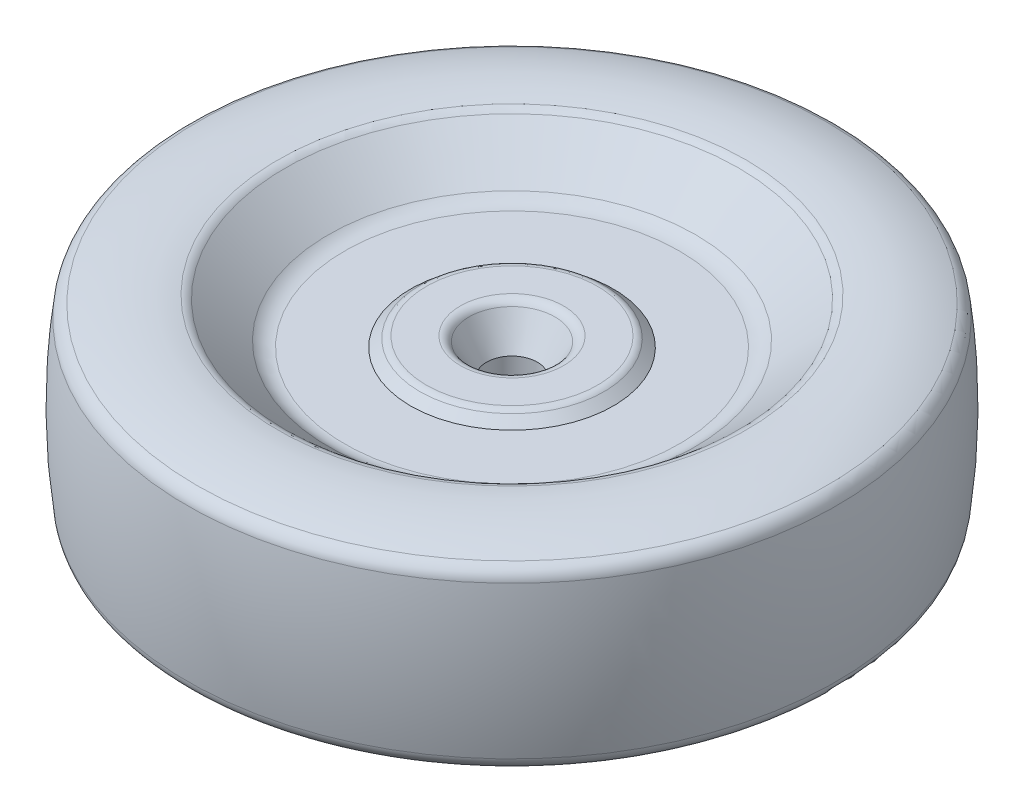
ISO-10303-21;
HEADER;
FILE_DESCRIPTION(('STEP AP214'),'2;1');
FILE_NAME('part.step','',(''),(''),'','','');
FILE_SCHEMA(('AUTOMOTIVE_DESIGN { 1 0 10303 214 1 1 1 1 }'));
ENDSEC;
DATA;
#1=APPLICATION_CONTEXT('core data for automotive mechanical design processes');
#2=APPLICATION_PROTOCOL_DEFINITION('international standard','automotive_design',2000,#1);
#3=PRODUCT_CONTEXT('',#1,'mechanical');
#4=PRODUCT('Part','Part','',(#3));
#5=PRODUCT_RELATED_PRODUCT_CATEGORY('part','',(#4));
#6=PRODUCT_DEFINITION_FORMATION('','',#4);
#7=PRODUCT_DEFINITION_CONTEXT('part definition',#1,'design');
#8=PRODUCT_DEFINITION('design','',#6,#7);
#9=PRODUCT_DEFINITION_SHAPE('','',#8);
#10=(LENGTH_UNIT() NAMED_UNIT(*) SI_UNIT(.MILLI.,.METRE.));
#11=(NAMED_UNIT(*) PLANE_ANGLE_UNIT() SI_UNIT($,.RADIAN.));
#12=(NAMED_UNIT(*) SI_UNIT($,.STERADIAN.) SOLID_ANGLE_UNIT());
#13=UNCERTAINTY_MEASURE_WITH_UNIT(LENGTH_MEASURE(1.E-05),#10,'distance_accuracy_value','');
#14=(GEOMETRIC_REPRESENTATION_CONTEXT(3) GLOBAL_UNCERTAINTY_ASSIGNED_CONTEXT((#13)) GLOBAL_UNIT_ASSIGNED_CONTEXT((#10,
#11,#12)) REPRESENTATION_CONTEXT('',''));
#15=CARTESIAN_POINT('',(0.,0.,0.));
#16=DIRECTION('',(0.,0.,1.));
#17=DIRECTION('',(1.,0.,0.));
#18=AXIS2_PLACEMENT_3D('',#15,#16,#17);
#19=CARTESIAN_POINT('',(0.,0.,0.));
#20=DIRECTION('',(0.,-1.,0.));
#21=DIRECTION('',(0.,0.,-1.));
#22=AXIS2_PLACEMENT_3D('',#19,#20,#21);
#23=DEGENERATE_TOROIDAL_SURFACE('',#22,55.,120.,.F.);
#24=CARTESIAN_POINT('',(0.,15.,0.));
#25=DIRECTION('',(0.,-1.,0.));
#26=DIRECTION('',(0.,0.,-1.));
#27=AXIS2_PLACEMENT_3D('',#24,#25,#26);
#28=CIRCLE('',#27,64.0588089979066);
#29=CARTESIAN_POINT('',(0.,15.,-64.0588089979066));
#30=VERTEX_POINT('',#29);
#31=EDGE_CURVE('E80',#30,#30,#28,.T.);
#32=ORIENTED_EDGE('',*,*,#31,.T.);
#33=EDGE_LOOP('',(#32));
#34=FACE_BOUND('',#33,.T.);
#35=CARTESIAN_POINT('',(0.,-15.,0.));
#36=DIRECTION('',(0.,-1.,0.));
#37=DIRECTION('',(0.,0.,-1.));
#38=AXIS2_PLACEMENT_3D('',#35,#36,#37);
#39=CIRCLE('',#38,64.0588089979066);
#40=CARTESIAN_POINT('',(0.,-15.,-64.0588089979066));
#41=VERTEX_POINT('',#40);
#42=EDGE_CURVE('E44',#41,#41,#39,.T.);
#43=ORIENTED_EDGE('',*,*,#42,.F.);
#44=EDGE_LOOP('',(#43));
#45=FACE_BOUND('',#44,.T.);
#46=ADVANCED_FACE('F34',(#34,#45),#23,.F.);
#47=CARTESIAN_POINT('',(0.,-14.625,0.));
#48=DIRECTION('',(0.,-1.,0.));
#49=DIRECTION('',(0.,0.,-1.));
#50=AXIS2_PLACEMENT_3D('',#47,#48,#49);
#51=TOROIDAL_SURFACE('',#50,61.0823387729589,3.00000000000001);
#52=ORIENTED_EDGE('',*,*,#42,.T.);
#53=EDGE_LOOP('',(#52));
#54=FACE_BOUND('',#53,.T.);
#55=CARTESIAN_POINT('',(0.,-17.4455272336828,0.));
#56=DIRECTION('',(0.,-1.,0.));
#57=DIRECTION('',(0.,0.,-1.));
#58=AXIS2_PLACEMENT_3D('',#55,#56,#57);
#59=CIRCLE('',#58,62.1044083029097);
#60=CARTESIAN_POINT('',(0.,-17.4455272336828,-62.1044083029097));
#61=VERTEX_POINT('',#60);
#62=EDGE_CURVE('E48',#61,#61,#59,.T.);
#63=ORIENTED_EDGE('',*,*,#62,.F.);
#64=EDGE_LOOP('',(#63));
#65=FACE_BOUND('',#64,.T.);
#66=ADVANCED_FACE('F126',(#54,#65),#51,.T.);
#67=CARTESIAN_POINT('',(0.,12.6400965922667,0.));
#68=DIRECTION('',(0.,-1.,0.));
#69=DIRECTION('',(0.,0.,-1.));
#70=AXIS2_PLACEMENT_3D('',#67,#68,#69);
#71=TOROIDAL_SURFACE('',#70,51.2023333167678,32.);
#72=ORIENTED_EDGE('',*,*,#62,.T.);
#73=EDGE_LOOP('',(#72));
#74=FACE_BOUND('',#73,.T.);
#75=CARTESIAN_POINT('',(0.,-18.9627686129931,0.));
#76=DIRECTION('',(0.,-1.,0.));
#77=DIRECTION('',(0.,0.,-1.));
#78=AXIS2_PLACEMENT_3D('',#75,#76,#77);
#79=CIRCLE('',#78,46.1765089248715);
#80=CARTESIAN_POINT('',(0.,-18.9627686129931,-46.1765089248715));
#81=VERTEX_POINT('',#80);
#82=EDGE_CURVE('E53',#81,#81,#79,.T.);
#83=ORIENTED_EDGE('',*,*,#82,.F.);
#84=EDGE_LOOP('',(#83));
#85=FACE_BOUND('',#84,.T.);
#86=ADVANCED_FACE('F131',(#74,#85),#71,.T.);
#87=CARTESIAN_POINT('',(0.,-16.,0.));
#88=DIRECTION('',(0.,-1.,0.));
#89=DIRECTION('',(0.,0.,-1.));
#90=AXIS2_PLACEMENT_3D('',#87,#88,#89);
#91=TOROIDAL_SURFACE('',#90,46.6476799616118,3.00000000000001);
#92=ORIENTED_EDGE('',*,*,#82,.T.);
#93=EDGE_LOOP('',(#92));
#94=FACE_BOUND('',#93,.T.);
#95=CARTESIAN_POINT('',(0.,-18.2992647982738,0.));
#96=DIRECTION('',(0.,-1.,0.));
#97=DIRECTION('',(0.,0.,-1.));
#98=AXIS2_PLACEMENT_3D('',#95,#96,#97);
#99=CIRCLE('',#98,44.7206663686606);
#100=CARTESIAN_POINT('',(0.,-18.2992647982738,-44.7206663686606));
#101=VERTEX_POINT('',#100);
#102=EDGE_CURVE('E56',#101,#101,#99,.T.);
#103=ORIENTED_EDGE('',*,*,#102,.F.);
#104=EDGE_LOOP('',(#103));
#105=FACE_BOUND('',#104,.T.);
#106=ADVANCED_FACE('F141',(#94,#105),#91,.T.);
#107=CARTESIAN_POINT('',(0.,-11.1678920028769,0.));
#108=DIRECTION('',(0.,-1.,0.));
#109=DIRECTION('',(0.,0.,-1.));
#110=AXIS2_PLACEMENT_3D('',#107,#108,#109);
#111=CONICAL_SURFACE('',#110,36.2116893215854,0.873251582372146);
#112=ORIENTED_EDGE('',*,*,#102,.T.);
#113=EDGE_LOOP('',(#112));
#114=FACE_BOUND('',#113,.T.);
#115=CARTESIAN_POINT('',(0.,-11.1678920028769,0.));
#116=DIRECTION('',(0.,-1.,0.));
#117=DIRECTION('',(0.,0.,-1.));
#118=AXIS2_PLACEMENT_3D('',#115,#116,#117);
#119=CIRCLE('',#118,36.2116893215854);
#120=CARTESIAN_POINT('',(0.,-11.1678920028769,-36.2116893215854));
#121=VERTEX_POINT('',#120);
#122=EDGE_CURVE('E59',#121,#121,#119,.T.);
#123=ORIENTED_EDGE('',*,*,#122,.F.);
#124=EDGE_LOOP('',(#123));
#125=FACE_BOUND('',#124,.T.);
#126=ADVANCED_FACE('F147',(#114,#125),#111,.F.);
#127=CARTESIAN_POINT('',(0.,-15.,0.));
#128=DIRECTION('',(0.,-1.,0.));
#129=DIRECTION('',(0.,0.,-1.));
#130=AXIS2_PLACEMENT_3D('',#127,#128,#129);
#131=TOROIDAL_SURFACE('',#130,33.,5.);
#132=ORIENTED_EDGE('',*,*,#122,.T.);
#133=EDGE_LOOP('',(#132));
#134=FACE_BOUND('',#133,.T.);
#135=CARTESIAN_POINT('',(0.,-10.,0.));
#136=DIRECTION('',(0.,-1.,0.));
#137=DIRECTION('',(0.,0.,-1.));
#138=AXIS2_PLACEMENT_3D('',#135,#136,#137);
#139=CIRCLE('',#138,33.);
#140=CARTESIAN_POINT('',(0.,-10.,-33.));
#141=VERTEX_POINT('',#140);
#142=EDGE_CURVE('E62',#141,#141,#139,.T.);
#143=ORIENTED_EDGE('',*,*,#142,.F.);
#144=EDGE_LOOP('',(#143));
#145=FACE_BOUND('',#144,.T.);
#146=ADVANCED_FACE('F153',(#134,#145),#131,.F.);
#147=CARTESIAN_POINT('',(10.,-10.,0.));
#148=DIRECTION('',(0.,-1.,0.));
#149=DIRECTION('',(0.,0.,-1.));
#150=AXIS2_PLACEMENT_3D('',#147,#148,#149);
#151=PLANE('',#150);
#152=CARTESIAN_POINT('',(0.,-10.,0.));
#153=DIRECTION('',(0.,-1.,0.));
#154=DIRECTION('',(0.,0.,-1.));
#155=AXIS2_PLACEMENT_3D('',#152,#153,#154);
#156=CIRCLE('',#155,20.);
#157=CARTESIAN_POINT('',(0.,-10.,-20.));
#158=VERTEX_POINT('',#157);
#159=EDGE_CURVE('E10',#158,#158,#156,.T.);
#160=ORIENTED_EDGE('',*,*,#159,.F.);
#161=EDGE_LOOP('',(#160));
#162=FACE_BOUND('',#161,.T.);
#163=ORIENTED_EDGE('',*,*,#142,.T.);
#164=EDGE_LOOP('',(#163));
#165=FACE_BOUND('',#164,.T.);
#166=ADVANCED_FACE('F159',(#162,#165),#151,.T.);
#167=CARTESIAN_POINT('',(10.,10.,0.));
#168=DIRECTION('',(0.,1.,0.));
#169=DIRECTION('',(0.,0.,1.));
#170=AXIS2_PLACEMENT_3D('',#167,#168,#169);
#171=PLANE('',#170);
#172=CARTESIAN_POINT('',(0.,10.,0.));
#173=DIRECTION('',(0.,1.,0.));
#174=DIRECTION('',(0.,0.,1.));
#175=AXIS2_PLACEMENT_3D('',#172,#173,#174);
#176=CIRCLE('',#175,20.);
#177=CARTESIAN_POINT('',(0.,10.,20.));
#178=VERTEX_POINT('',#177);
#179=EDGE_CURVE('E40',#178,#178,#176,.T.);
#180=ORIENTED_EDGE('',*,*,#179,.F.);
#181=EDGE_LOOP('',(#180));
#182=FACE_BOUND('',#181,.T.);
#183=CARTESIAN_POINT('',(0.,10.,0.));
#184=DIRECTION('',(0.,-1.,0.));
#185=DIRECTION('',(0.,0.,-1.));
#186=AXIS2_PLACEMENT_3D('',#183,#184,#185);
#187=CIRCLE('',#186,33.);
#188=CARTESIAN_POINT('',(0.,10.,-33.));
#189=VERTEX_POINT('',#188);
#190=EDGE_CURVE('E65',#189,#189,#187,.T.);
#191=ORIENTED_EDGE('',*,*,#190,.F.);
#192=EDGE_LOOP('',(#191));
#193=FACE_BOUND('',#192,.T.);
#194=ADVANCED_FACE('F164',(#182,#193),#171,.T.);
#195=CARTESIAN_POINT('',(0.,15.,0.));
#196=DIRECTION('',(0.,-1.,0.));
#197=DIRECTION('',(0.,0.,-1.));
#198=AXIS2_PLACEMENT_3D('',#195,#196,#197);
#199=TOROIDAL_SURFACE('',#198,33.,5.);
#200=ORIENTED_EDGE('',*,*,#190,.T.);
#201=EDGE_LOOP('',(#200));
#202=FACE_BOUND('',#201,.T.);
#203=CARTESIAN_POINT('',(0.,11.1678920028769,0.));
#204=DIRECTION('',(0.,-1.,0.));
#205=DIRECTION('',(0.,0.,-1.));
#206=AXIS2_PLACEMENT_3D('',#203,#204,#205);
#207=CIRCLE('',#206,36.2116893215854);
#208=CARTESIAN_POINT('',(0.,11.1678920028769,-36.2116893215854));
#209=VERTEX_POINT('',#208);
#210=EDGE_CURVE('E68',#209,#209,#207,.T.);
#211=ORIENTED_EDGE('',*,*,#210,.F.);
#212=EDGE_LOOP('',(#211));
#213=FACE_BOUND('',#212,.T.);
#214=ADVANCED_FACE('F170',(#202,#213),#199,.F.);
#215=CARTESIAN_POINT('',(0.,18.2992647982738,0.));
#216=DIRECTION('',(0.,1.,0.));
#217=DIRECTION('',(0.,0.,1.));
#218=AXIS2_PLACEMENT_3D('',#215,#216,#217);
#219=CONICAL_SURFACE('',#218,44.7206663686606,0.873251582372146);
#220=ORIENTED_EDGE('',*,*,#210,.T.);
#221=EDGE_LOOP('',(#220));
#222=FACE_BOUND('',#221,.T.);
#223=CARTESIAN_POINT('',(0.,18.2992647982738,0.));
#224=DIRECTION('',(0.,-1.,0.));
#225=DIRECTION('',(0.,0.,-1.));
#226=AXIS2_PLACEMENT_3D('',#223,#224,#225);
#227=CIRCLE('',#226,44.7206663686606);
#228=CARTESIAN_POINT('',(0.,18.2992647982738,-44.7206663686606));
#229=VERTEX_POINT('',#228);
#230=EDGE_CURVE('E71',#229,#229,#227,.T.);
#231=ORIENTED_EDGE('',*,*,#230,.F.);
#232=EDGE_LOOP('',(#231));
#233=FACE_BOUND('',#232,.T.);
#234=ADVANCED_FACE('F176',(#222,#233),#219,.F.);
#235=CARTESIAN_POINT('',(0.,16.,0.));
#236=DIRECTION('',(0.,-1.,0.));
#237=DIRECTION('',(0.,0.,-1.));
#238=AXIS2_PLACEMENT_3D('',#235,#236,#237);
#239=TOROIDAL_SURFACE('',#238,46.6476799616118,3.);
#240=ORIENTED_EDGE('',*,*,#230,.T.);
#241=EDGE_LOOP('',(#240));
#242=FACE_BOUND('',#241,.T.);
#243=CARTESIAN_POINT('',(0.,18.9627686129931,0.));
#244=DIRECTION('',(0.,-1.,0.));
#245=DIRECTION('',(0.,0.,-1.));
#246=AXIS2_PLACEMENT_3D('',#243,#244,#245);
#247=CIRCLE('',#246,46.1765089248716);
#248=CARTESIAN_POINT('',(0.,18.9627686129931,-46.1765089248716));
#249=VERTEX_POINT('',#248);
#250=EDGE_CURVE('E74',#249,#249,#247,.T.);
#251=ORIENTED_EDGE('',*,*,#250,.F.);
#252=EDGE_LOOP('',(#251));
#253=FACE_BOUND('',#252,.T.);
#254=ADVANCED_FACE('F180',(#242,#253),#239,.T.);
#255=CARTESIAN_POINT('',(0.,-12.6400965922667,0.));
#256=DIRECTION('',(0.,-1.,0.));
#257=DIRECTION('',(0.,0.,-1.));
#258=AXIS2_PLACEMENT_3D('',#255,#256,#257);
#259=TOROIDAL_SURFACE('',#258,51.2023333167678,32.);
#260=ORIENTED_EDGE('',*,*,#250,.T.);
#261=EDGE_LOOP('',(#260));
#262=FACE_BOUND('',#261,.T.);
#263=CARTESIAN_POINT('',(0.,17.4455272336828,0.));
#264=DIRECTION('',(0.,-1.,0.));
#265=DIRECTION('',(0.,0.,-1.));
#266=AXIS2_PLACEMENT_3D('',#263,#264,#265);
#267=CIRCLE('',#266,62.1044083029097);
#268=CARTESIAN_POINT('',(0.,17.4455272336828,-62.1044083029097));
#269=VERTEX_POINT('',#268);
#270=EDGE_CURVE('E77',#269,#269,#267,.T.);
#271=ORIENTED_EDGE('',*,*,#270,.F.);
#272=EDGE_LOOP('',(#271));
#273=FACE_BOUND('',#272,.T.);
#274=ADVANCED_FACE('F184',(#262,#273),#259,.T.);
#275=CARTESIAN_POINT('',(0.,14.625,0.));
#276=DIRECTION('',(0.,-1.,0.));
#277=DIRECTION('',(0.,0.,-1.));
#278=AXIS2_PLACEMENT_3D('',#275,#276,#277);
#279=TOROIDAL_SURFACE('',#278,61.0823387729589,3.00000000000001);
#280=ORIENTED_EDGE('',*,*,#270,.T.);
#281=EDGE_LOOP('',(#280));
#282=FACE_BOUND('',#281,.T.);
#283=ORIENTED_EDGE('',*,*,#31,.F.);
#284=EDGE_LOOP('',(#283));
#285=FACE_BOUND('',#284,.T.);
#286=ADVANCED_FACE('F188',(#282,#285),#279,.T.);
#287=CARTESIAN_POINT('',(0.,-10.,0.));
#288=DIRECTION('',(0.,1.,0.));
#289=DIRECTION('',(0.,0.,1.));
#290=AXIS2_PLACEMENT_3D('',#287,#288,#289);
#291=CONICAL_SURFACE('',#290,20.,0.872664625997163);
#292=CARTESIAN_POINT('',(0.,-11.532088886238,0.));
#293=DIRECTION('',(0.,1.,0.));
#294=DIRECTION('',(0.,0.,1.));
#295=AXIS2_PLACEMENT_3D('',#292,#293,#294);
#296=CIRCLE('',#295,18.1741275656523);
#297=CARTESIAN_POINT('',(0.,-11.532088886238,18.1741275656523));
#298=VERTEX_POINT('',#297);
#299=EDGE_CURVE('E83',#298,#298,#296,.T.);
#300=ORIENTED_EDGE('',*,*,#299,.T.);
#301=EDGE_LOOP('',(#300));
#302=FACE_BOUND('',#301,.T.);
#303=ORIENTED_EDGE('',*,*,#159,.T.);
#304=EDGE_LOOP('',(#303));
#305=FACE_BOUND('',#304,.T.);
#306=ADVANCED_FACE('F192',(#302,#305),#291,.T.);
#307=CARTESIAN_POINT('',(0.,-10.,0.));
#308=DIRECTION('',(0.,1.,0.));
#309=DIRECTION('',(0.,0.,1.));
#310=AXIS2_PLACEMENT_3D('',#307,#308,#309);
#311=TOROIDAL_SURFACE('',#310,16.8885523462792,2.);
#312=CARTESIAN_POINT('',(0.,-12.,0.));
#313=DIRECTION('',(0.,1.,0.));
#314=DIRECTION('',(0.,0.,1.));
#315=AXIS2_PLACEMENT_3D('',#312,#313,#314);
#316=CIRCLE('',#315,16.8885523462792);
#317=CARTESIAN_POINT('',(0.,-12.,16.8885523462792));
#318=VERTEX_POINT('',#317);
#319=EDGE_CURVE('E86',#318,#318,#316,.T.);
#320=ORIENTED_EDGE('',*,*,#319,.T.);
#321=EDGE_LOOP('',(#320));
#322=FACE_BOUND('',#321,.T.);
#323=ORIENTED_EDGE('',*,*,#299,.F.);
#324=EDGE_LOOP('',(#323));
#325=FACE_BOUND('',#324,.T.);
#326=ADVANCED_FACE('F196',(#322,#325),#311,.T.);
#327=CARTESIAN_POINT('',(0.,-12.,16.8885523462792));
#328=DIRECTION('',(0.,-1.,0.));
#329=DIRECTION('',(0.,0.,-1.));
#330=AXIS2_PLACEMENT_3D('',#327,#328,#329);
#331=PLANE('',#330);
#332=CARTESIAN_POINT('',(0.,-12.,0.));
#333=DIRECTION('',(0.,1.,0.));
#334=DIRECTION('',(0.,0.,1.));
#335=AXIS2_PLACEMENT_3D('',#332,#333,#334);
#336=CIRCLE('',#335,10.1961524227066);
#337=CARTESIAN_POINT('',(0.,-12.,10.1961524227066));
#338=VERTEX_POINT('',#337);
#339=EDGE_CURVE('E89',#338,#338,#336,.T.);
#340=ORIENTED_EDGE('',*,*,#339,.T.);
#341=EDGE_LOOP('',(#340));
#342=FACE_BOUND('',#341,.T.);
#343=ORIENTED_EDGE('',*,*,#319,.F.);
#344=EDGE_LOOP('',(#343));
#345=FACE_BOUND('',#344,.T.);
#346=ADVANCED_FACE('F200',(#342,#345),#331,.T.);
#347=CARTESIAN_POINT('',(0.,-10.,0.));
#348=DIRECTION('',(0.,1.,0.));
#349=DIRECTION('',(0.,0.,1.));
#350=AXIS2_PLACEMENT_3D('',#347,#348,#349);
#351=TOROIDAL_SURFACE('',#350,10.1961524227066,2.);
#352=CARTESIAN_POINT('',(0.,-11.,0.));
#353=DIRECTION('',(0.,1.,0.));
#354=DIRECTION('',(0.,0.,1.));
#355=AXIS2_PLACEMENT_3D('',#352,#353,#354);
#356=CIRCLE('',#355,8.46410161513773);
#357=CARTESIAN_POINT('',(0.,-11.,8.46410161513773));
#358=VERTEX_POINT('',#357);
#359=EDGE_CURVE('E92',#358,#358,#356,.T.);
#360=ORIENTED_EDGE('',*,*,#359,.T.);
#361=EDGE_LOOP('',(#360));
#362=FACE_BOUND('',#361,.T.);
#363=ORIENTED_EDGE('',*,*,#339,.F.);
#364=EDGE_LOOP('',(#363));
#365=FACE_BOUND('',#364,.T.);
#366=ADVANCED_FACE('F204',(#362,#365),#351,.T.);
#367=CARTESIAN_POINT('',(0.,-11.,0.));
#368=DIRECTION('',(0.,-1.,0.));
#369=DIRECTION('',(0.,0.,-1.));
#370=AXIS2_PLACEMENT_3D('',#367,#368,#369);
#371=CONICAL_SURFACE('',#370,8.46410161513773,0.523598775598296);
#372=CARTESIAN_POINT('',(0.,-5.,0.));
#373=DIRECTION('',(0.,1.,0.));
#374=DIRECTION('',(0.,0.,1.));
#375=AXIS2_PLACEMENT_3D('',#372,#373,#374);
#376=CIRCLE('',#375,5.);
#377=CARTESIAN_POINT('',(0.,-5.,5.));
#378=VERTEX_POINT('',#377);
#379=EDGE_CURVE('E95',#378,#378,#376,.T.);
#380=ORIENTED_EDGE('',*,*,#379,.T.);
#381=EDGE_LOOP('',(#380));
#382=FACE_BOUND('',#381,.T.);
#383=ORIENTED_EDGE('',*,*,#359,.F.);
#384=EDGE_LOOP('',(#383));
#385=FACE_BOUND('',#384,.T.);
#386=ADVANCED_FACE('F208',(#382,#385),#371,.F.);
#387=CARTESIAN_POINT('',(0.,0.,0.));
#388=DIRECTION('',(0.,1.,0.));
#389=DIRECTION('',(0.,0.,1.));
#390=AXIS2_PLACEMENT_3D('',#387,#388,#389);
#391=CYLINDRICAL_SURFACE('',#390,5.);
#392=CARTESIAN_POINT('',(0.,5.,0.));
#393=DIRECTION('',(0.,1.,0.));
#394=DIRECTION('',(0.,0.,1.));
#395=AXIS2_PLACEMENT_3D('',#392,#393,#394);
#396=CIRCLE('',#395,5.);
#397=CARTESIAN_POINT('',(0.,5.,5.));
#398=VERTEX_POINT('',#397);
#399=EDGE_CURVE('E98',#398,#398,#396,.T.);
#400=ORIENTED_EDGE('',*,*,#399,.T.);
#401=EDGE_LOOP('',(#400));
#402=FACE_BOUND('',#401,.T.);
#403=ORIENTED_EDGE('',*,*,#379,.F.);
#404=EDGE_LOOP('',(#403));
#405=FACE_BOUND('',#404,.T.);
#406=ADVANCED_FACE('F212',(#402,#405),#391,.F.);
#407=CARTESIAN_POINT('',(0.,5.,0.));
#408=DIRECTION('',(0.,1.,0.));
#409=DIRECTION('',(0.,0.,1.));
#410=AXIS2_PLACEMENT_3D('',#407,#408,#409);
#411=CONICAL_SURFACE('',#410,5.,0.523598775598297);
#412=CARTESIAN_POINT('',(0.,11.,0.));
#413=DIRECTION('',(0.,1.,0.));
#414=DIRECTION('',(0.,0.,1.));
#415=AXIS2_PLACEMENT_3D('',#412,#413,#414);
#416=CIRCLE('',#415,8.46410161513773);
#417=CARTESIAN_POINT('',(0.,11.,8.46410161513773));
#418=VERTEX_POINT('',#417);
#419=EDGE_CURVE('E101',#418,#418,#416,.T.);
#420=ORIENTED_EDGE('',*,*,#419,.T.);
#421=EDGE_LOOP('',(#420));
#422=FACE_BOUND('',#421,.T.);
#423=ORIENTED_EDGE('',*,*,#399,.F.);
#424=EDGE_LOOP('',(#423));
#425=FACE_BOUND('',#424,.T.);
#426=ADVANCED_FACE('F216',(#422,#425),#411,.F.);
#427=CARTESIAN_POINT('',(0.,10.,0.));
#428=DIRECTION('',(0.,1.,0.));
#429=DIRECTION('',(0.,0.,1.));
#430=AXIS2_PLACEMENT_3D('',#427,#428,#429);
#431=TOROIDAL_SURFACE('',#430,10.1961524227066,2.);
#432=CARTESIAN_POINT('',(0.,12.,0.));
#433=DIRECTION('',(0.,1.,0.));
#434=DIRECTION('',(0.,0.,1.));
#435=AXIS2_PLACEMENT_3D('',#432,#433,#434);
#436=CIRCLE('',#435,10.1961524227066);
#437=CARTESIAN_POINT('',(0.,12.,10.1961524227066));
#438=VERTEX_POINT('',#437);
#439=EDGE_CURVE('E104',#438,#438,#436,.T.);
#440=ORIENTED_EDGE('',*,*,#439,.T.);
#441=EDGE_LOOP('',(#440));
#442=FACE_BOUND('',#441,.T.);
#443=ORIENTED_EDGE('',*,*,#419,.F.);
#444=EDGE_LOOP('',(#443));
#445=FACE_BOUND('',#444,.T.);
#446=ADVANCED_FACE('F220',(#442,#445),#431,.T.);
#447=CARTESIAN_POINT('',(0.,12.,16.8885523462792));
#448=DIRECTION('',(0.,1.,0.));
#449=DIRECTION('',(0.,0.,1.));
#450=AXIS2_PLACEMENT_3D('',#447,#448,#449);
#451=PLANE('',#450);
#452=CARTESIAN_POINT('',(0.,12.,0.));
#453=DIRECTION('',(0.,1.,0.));
#454=DIRECTION('',(0.,0.,1.));
#455=AXIS2_PLACEMENT_3D('',#452,#453,#454);
#456=CIRCLE('',#455,16.8885523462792);
#457=CARTESIAN_POINT('',(0.,12.,16.8885523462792));
#458=VERTEX_POINT('',#457);
#459=EDGE_CURVE('E107',#458,#458,#456,.T.);
#460=ORIENTED_EDGE('',*,*,#459,.T.);
#461=EDGE_LOOP('',(#460));
#462=FACE_BOUND('',#461,.T.);
#463=ORIENTED_EDGE('',*,*,#439,.F.);
#464=EDGE_LOOP('',(#463));
#465=FACE_BOUND('',#464,.T.);
#466=ADVANCED_FACE('F123',(#462,#465),#451,.T.);
#467=CARTESIAN_POINT('',(0.,10.,0.));
#468=DIRECTION('',(0.,1.,0.));
#469=DIRECTION('',(0.,0.,1.));
#470=AXIS2_PLACEMENT_3D('',#467,#468,#469);
#471=TOROIDAL_SURFACE('',#470,16.8885523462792,2.);
#472=CARTESIAN_POINT('',(0.,11.532088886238,0.));
#473=DIRECTION('',(0.,1.,0.));
#474=DIRECTION('',(0.,0.,1.));
#475=AXIS2_PLACEMENT_3D('',#472,#473,#474);
#476=CIRCLE('',#475,18.1741275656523);
#477=CARTESIAN_POINT('',(0.,11.532088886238,18.1741275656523));
#478=VERTEX_POINT('',#477);
#479=EDGE_CURVE('E110',#478,#478,#476,.T.);
#480=ORIENTED_EDGE('',*,*,#479,.T.);
#481=EDGE_LOOP('',(#480));
#482=FACE_BOUND('',#481,.T.);
#483=ORIENTED_EDGE('',*,*,#459,.F.);
#484=EDGE_LOOP('',(#483));
#485=FACE_BOUND('',#484,.T.);
#486=ADVANCED_FACE('F114',(#482,#485),#471,.T.);
#487=CARTESIAN_POINT('',(0.,11.532088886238,0.));
#488=DIRECTION('',(0.,-1.,0.));
#489=DIRECTION('',(0.,0.,-1.));
#490=AXIS2_PLACEMENT_3D('',#487,#488,#489);
#491=CONICAL_SURFACE('',#490,18.1741275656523,0.872664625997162);
#492=ORIENTED_EDGE('',*,*,#179,.T.);
#493=EDGE_LOOP('',(#492));
#494=FACE_BOUND('',#493,.T.);
#495=ORIENTED_EDGE('',*,*,#479,.F.);
#496=EDGE_LOOP('',(#495));
#497=FACE_BOUND('',#496,.T.);
#498=ADVANCED_FACE('F117',(#494,#497),#491,.T.);
#499=CLOSED_SHELL('',(#46,#66,#86,#106,#126,#146,#166,#194,#214,#234,#254,#274,#286,#306,#326,
#346,#366,#386,#406,#426,#446,#466,#486,#498));
#500=MANIFOLD_SOLID_BREP('B2',#499);
#501=ADVANCED_BREP_SHAPE_REPRESENTATION('',(#18,#500),#14);
#502=SHAPE_DEFINITION_REPRESENTATION(#9,#501);
ENDSEC;
END-ISO-10303-21;
